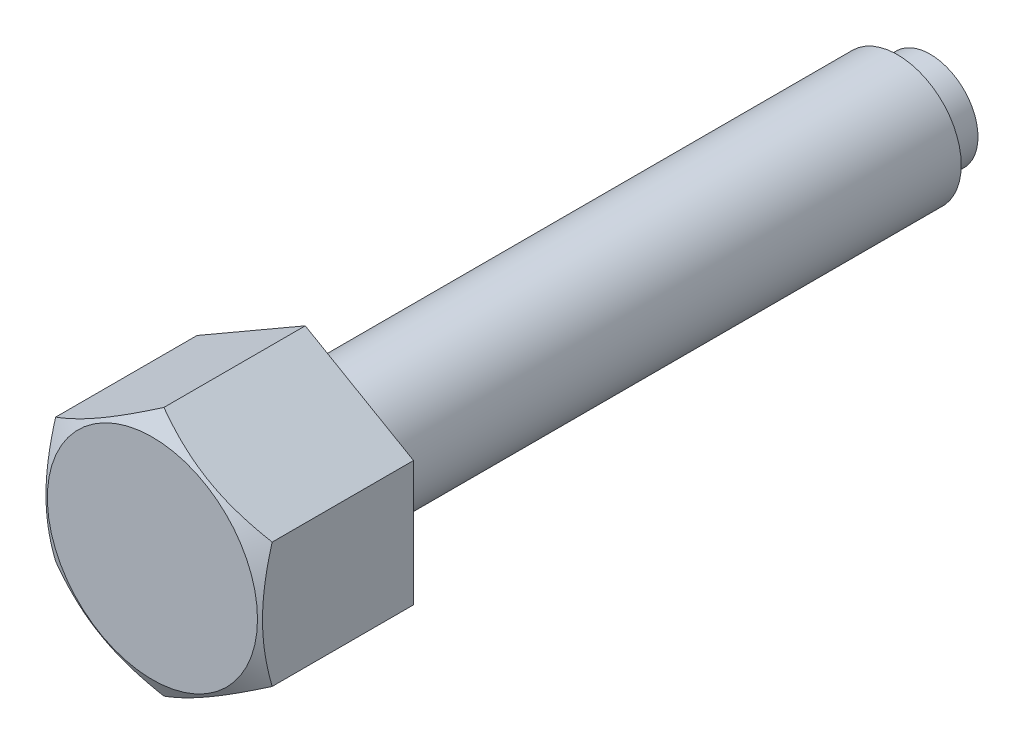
ISO-10303-21;
HEADER;
FILE_DESCRIPTION(('STEP AP214'),'2;1');
FILE_NAME('part.step','',(''),(''),'','','');
FILE_SCHEMA(('AUTOMOTIVE_DESIGN { 1 0 10303 214 1 1 1 1 }'));
ENDSEC;
DATA;
#1=APPLICATION_CONTEXT('core data for automotive mechanical design processes');
#2=APPLICATION_PROTOCOL_DEFINITION('international standard','automotive_design',2000,#1);
#3=PRODUCT_CONTEXT('',#1,'mechanical');
#4=PRODUCT('Part','Part','',(#3));
#5=PRODUCT_RELATED_PRODUCT_CATEGORY('part','',(#4));
#6=PRODUCT_DEFINITION_FORMATION('','',#4);
#7=PRODUCT_DEFINITION_CONTEXT('part definition',#1,'design');
#8=PRODUCT_DEFINITION('design','',#6,#7);
#9=PRODUCT_DEFINITION_SHAPE('','',#8);
#10=(LENGTH_UNIT() NAMED_UNIT(*) SI_UNIT(.MILLI.,.METRE.));
#11=(NAMED_UNIT(*) PLANE_ANGLE_UNIT() SI_UNIT($,.RADIAN.));
#12=(NAMED_UNIT(*) SI_UNIT($,.STERADIAN.) SOLID_ANGLE_UNIT());
#13=UNCERTAINTY_MEASURE_WITH_UNIT(LENGTH_MEASURE(1.E-05),#10,'distance_accuracy_value','');
#14=(GEOMETRIC_REPRESENTATION_CONTEXT(3) GLOBAL_UNCERTAINTY_ASSIGNED_CONTEXT((#13)) GLOBAL_UNIT_ASSIGNED_CONTEXT((#10,
#11,#12)) REPRESENTATION_CONTEXT('',''));
#15=CARTESIAN_POINT('',(0.,0.,0.));
#16=DIRECTION('',(0.,0.,1.));
#17=DIRECTION('',(1.,0.,0.));
#18=AXIS2_PLACEMENT_3D('',#15,#16,#17);
#19=CARTESIAN_POINT('',(0.,9.81495457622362,48.));
#20=DIRECTION('',(-0.5,-0.86602540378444,0.));
#21=DIRECTION('',(0.86602540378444,-0.5,0.));
#22=AXIS2_PLACEMENT_3D('',#19,#20,#21);
#23=PLANE('',#22);
#24=CARTESIAN_POINT('',(8.5002,4.90736181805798,61.0964063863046));
#25=CARTESIAN_POINT('',(8.31336077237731,5.01523349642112,61.1586762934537));
#26=CARTESIAN_POINT('',(8.12582494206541,5.1235073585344,61.2181201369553));
#27=CARTESIAN_POINT('',(7.74923024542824,5.34093440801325,61.3305773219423));
#28=CARTESIAN_POINT('',(7.56017075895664,5.45008795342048,61.3835878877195));
#29=CARTESIAN_POINT('',(6.98996524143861,5.77929626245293,61.5319290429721));
#30=CARTESIAN_POINT('',(6.60656835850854,6.00065055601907,61.6163035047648));
#31=CARTESIAN_POINT('',(6.03282233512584,6.33190297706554,61.7152424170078));
#32=CARTESIAN_POINT('',(5.84418723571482,6.44081150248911,61.7434272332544));
#33=CARTESIAN_POINT('',(5.46606397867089,6.65912106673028,61.7906883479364));
#34=CARTESIAN_POINT('',(5.27657589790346,6.76852206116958,61.8097654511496));
#35=CARTESIAN_POINT('',(4.8972734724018,6.98751241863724,61.8383276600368));
#36=CARTESIAN_POINT('',(4.70745974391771,7.09710142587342,61.8478236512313));
#37=CARTESIAN_POINT('',(4.32765694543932,7.31638067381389,61.8570200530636));
#38=CARTESIAN_POINT('',(4.13766788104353,7.42607091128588,61.8567207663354));
#39=CARTESIAN_POINT('',(3.78247698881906,7.63114046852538,61.8470079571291));
#40=CARTESIAN_POINT('',(3.61725009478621,7.72653426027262,61.838779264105));
#41=CARTESIAN_POINT('',(3.28718328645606,7.91709842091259,61.8150731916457));
#42=CARTESIAN_POINT('',(3.12234339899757,8.01226877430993,61.7995953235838));
#43=CARTESIAN_POINT('',(2.62846189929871,8.29741139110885,61.742653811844));
#44=CARTESIAN_POINT('',(2.30029449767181,8.4868789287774,61.690689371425));
#45=CARTESIAN_POINT('',(1.64047857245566,8.86782383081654,61.5607774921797));
#46=CARTESIAN_POINT('',(1.30891425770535,9.05925257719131,61.4822793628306));
#47=CARTESIAN_POINT('',(0.650730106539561,9.43925537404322,61.30412109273));
#48=CARTESIAN_POINT('',(0.324101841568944,9.62783429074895,61.2045027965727));
#49=CARTESIAN_POINT('',(-0.000199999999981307,9.81507004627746,61.0964063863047));
#50=B_SPLINE_CURVE_WITH_KNOTS('',3,(#24,#25,#26,#27,#28,#29,#30,#31,#32,#33,#34,#35,#36,#37,#38,
#39,#40,#41,#42,#43,#44,#45,#46,#47,#48,#49),.UNSPECIFIED.,.F.,.F.,(4,2,2,2,2,2,2,2,2,2,2,2,4),
(0.,0.673596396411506,1.34748239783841,2.69805431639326,3.356799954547,4.01548737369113,
4.67342558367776,5.33134346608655,5.90409556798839,6.47688628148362,7.62328361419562,
8.79510569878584,9.96462743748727),.UNSPECIFIED.);
#51=CARTESIAN_POINT('',(8.5,4.90747728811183,61.0964730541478));
#52=VERTEX_POINT('',#51);
#53=CARTESIAN_POINT('',(0.,9.81495457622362,61.0964730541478));
#54=VERTEX_POINT('',#53);
#55=EDGE_CURVE('E29',#52,#54,#50,.T.);
#56=ORIENTED_EDGE('',*,*,#55,.F.);
#57=DIRECTION('',(0.,0.,1.));
#58=VECTOR('',#57,1.);
#59=CARTESIAN_POINT('',(8.5,4.90747728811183,48.));
#60=LINE('',#59,#58);
#61=CARTESIAN_POINT('',(8.5,4.90747728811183,50.));
#62=VERTEX_POINT('',#61);
#63=EDGE_CURVE('E96',#62,#52,#60,.T.);
#64=ORIENTED_EDGE('',*,*,#63,.F.);
#65=DIRECTION('',(0.86602540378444,-0.5,0.));
#66=VECTOR('',#65,1.);
#67=CARTESIAN_POINT('',(8.,5.19615242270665,50.));
#68=LINE('',#67,#66);
#69=CARTESIAN_POINT('',(0.,9.81495457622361,50.));
#70=VERTEX_POINT('',#69);
#71=EDGE_CURVE('E110',#70,#62,#68,.T.);
#72=ORIENTED_EDGE('',*,*,#71,.F.);
#73=DIRECTION('',(0.,0.,1.));
#74=VECTOR('',#73,1.);
#75=CARTESIAN_POINT('',(0.,9.81495457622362,48.));
#76=LINE('',#75,#74);
#77=EDGE_CURVE('E36',#70,#54,#76,.T.);
#78=ORIENTED_EDGE('',*,*,#77,.T.);
#79=EDGE_LOOP('',(#56,#64,#72,#78));
#80=FACE_BOUND('',#79,.T.);
#81=ADVANCED_FACE('F14',(#80),#23,.F.);
#82=CARTESIAN_POINT('',(8.5,4.90747728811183,48.));
#83=DIRECTION('',(-1.,0.,0.));
#84=DIRECTION('',(0.,0.,1.));
#85=AXIS2_PLACEMENT_3D('',#82,#83,#84);
#86=PLANE('',#85);
#87=CARTESIAN_POINT('',(8.5,-13.199954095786,57.6987627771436));
#88=CARTESIAN_POINT('',(8.5,-12.8285538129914,57.8789969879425));
#89=CARTESIAN_POINT('',(8.5,-12.4563028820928,58.0575082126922));
#90=CARTESIAN_POINT('',(8.5,-11.7096474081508,58.410116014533));
#91=CARTESIAN_POINT('',(8.5,-11.3352425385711,58.5842118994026));
#92=CARTESIAN_POINT('',(8.5,-10.5819064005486,58.927892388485));
#93=CARTESIAN_POINT('',(8.5,-10.2029615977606,59.0974474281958));
#94=CARTESIAN_POINT('',(8.5,-9.44206432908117,59.4296426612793));
#95=CARTESIAN_POINT('',(8.5,-9.06011200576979,59.5922831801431));
#96=CARTESIAN_POINT('',(8.5,-8.2801924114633,59.9139382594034));
#97=CARTESIAN_POINT('',(8.5,-7.88210625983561,60.0726661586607));
#98=CARTESIAN_POINT('',(8.5,-7.08128418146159,60.3781521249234));
#99=CARTESIAN_POINT('',(8.5,-6.67854773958,60.524908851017));
#100=CARTESIAN_POINT('',(8.5,-5.86852751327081,60.8026124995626));
#101=CARTESIAN_POINT('',(8.5,-5.46125476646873,60.9335912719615));
#102=CARTESIAN_POINT('',(8.5,-4.64088165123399,61.1755495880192));
#103=CARTESIAN_POINT('',(8.5,-4.22778315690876,61.2865354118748));
#104=CARTESIAN_POINT('',(8.5,-3.39775322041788,61.4825945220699));
#105=CARTESIAN_POINT('',(8.5,-2.98085606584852,61.5678090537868));
#106=CARTESIAN_POINT('',(8.5,-2.35169960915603,61.6726226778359));
#107=CARTESIAN_POINT('',(8.5,-2.14133035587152,61.7037272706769));
#108=CARTESIAN_POINT('',(8.5,-1.71954012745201,61.7576573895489));
#109=CARTESIAN_POINT('',(8.5,-1.50811925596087,61.7804837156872));
#110=CARTESIAN_POINT('',(8.5,-1.08727895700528,61.8171153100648));
#111=CARTESIAN_POINT('',(8.5,-0.877869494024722,61.8310346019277));
#112=CARTESIAN_POINT('',(8.5,-0.458649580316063,61.850004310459));
#113=CARTESIAN_POINT('',(8.5,-0.248839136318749,61.8550548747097));
#114=CARTESIAN_POINT('',(8.5,0.17080753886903,61.8561665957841));
#115=CARTESIAN_POINT('',(8.5,0.380643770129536,61.8522277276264));
#116=CARTESIAN_POINT('',(8.5,0.799963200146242,61.8354570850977));
#117=CARTESIAN_POINT('',(8.5,1.00944638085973,61.8226248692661));
#118=CARTESIAN_POINT('',(8.5,1.51235445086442,61.7814150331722));
#119=CARTESIAN_POINT('',(8.5,1.80544333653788,61.7488480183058));
#120=CARTESIAN_POINT('',(8.5,2.38944378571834,61.6680780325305));
#121=CARTESIAN_POINT('',(8.5,2.68035504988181,61.6198729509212));
#122=CARTESIAN_POINT('',(8.5,3.5494909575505,61.4543568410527));
#123=CARTESIAN_POINT('',(8.5,4.12379349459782,61.316175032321));
#124=CARTESIAN_POINT('',(8.5,4.9825522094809,61.0765739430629));
#125=CARTESIAN_POINT('',(8.5,5.27146309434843,60.9902027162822));
#126=CARTESIAN_POINT('',(8.5,5.84647878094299,60.8084934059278));
#127=CARTESIAN_POINT('',(8.5,6.13258356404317,60.7131552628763));
#128=CARTESIAN_POINT('',(8.5,6.70207709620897,60.5150414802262));
#129=CARTESIAN_POINT('',(8.5,6.98546670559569,60.4122682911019));
#130=CARTESIAN_POINT('',(8.5,7.54989820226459,60.2004932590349));
#131=CARTESIAN_POINT('',(8.5,7.8309401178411,60.0914914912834));
#132=CARTESIAN_POINT('',(8.5,8.49732843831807,59.8258893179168));
#133=CARTESIAN_POINT('',(8.5,8.88173638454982,59.6669386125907));
#134=CARTESIAN_POINT('',(8.5,9.64725587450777,59.3412652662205));
#135=CARTESIAN_POINT('',(8.5,10.0283672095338,59.1745421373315));
#136=CARTESIAN_POINT('',(8.5,10.7879128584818,58.8348914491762));
#137=CARTESIAN_POINT('',(8.5,11.1663465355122,58.6619624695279));
#138=CARTESIAN_POINT('',(8.5,11.9208996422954,58.3111608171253));
#139=CARTESIAN_POINT('',(8.5,12.2970191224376,58.1332882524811));
#140=CARTESIAN_POINT('',(8.5,13.0477502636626,57.7733304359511));
#141=CARTESIAN_POINT('',(8.5,13.4223597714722,57.5912407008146));
#142=CARTESIAN_POINT('',(8.5,14.1699554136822,57.2237599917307));
#143=CARTESIAN_POINT('',(8.5,14.5429415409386,57.0383690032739));
#144=CARTESIAN_POINT('',(8.5,15.6597570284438,56.4781764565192));
#145=CARTESIAN_POINT('',(8.5,16.4015452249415,56.0993061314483));
#146=CARTESIAN_POINT('',(8.5,17.8184701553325,55.3663857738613));
#147=CARTESIAN_POINT('',(8.5,18.4939278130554,55.0129533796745));
#148=CARTESIAN_POINT('',(8.5,19.8423362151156,54.3012826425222));
#149=CARTESIAN_POINT('',(8.5,20.5152868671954,53.9430441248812));
#150=CARTESIAN_POINT('',(8.5,21.8575279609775,53.2238256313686));
#151=CARTESIAN_POINT('',(8.5,22.5268233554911,52.862854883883));
#152=CARTESIAN_POINT('',(8.5,23.8638133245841,52.1380488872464));
#153=CARTESIAN_POINT('',(8.5,24.5315079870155,51.7742138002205));
#154=CARTESIAN_POINT('',(8.5,25.1986146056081,51.4093109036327));
#155=B_SPLINE_CURVE_WITH_KNOTS('',3,(#87,#88,#89,#90,#91,#92,#93,#94,#95,#96,#97,#98,#99,#100,
#101,#102,#103,#104,#105,#106,#107,#108,#109,#110,#111,#112,#113,#114,#115,#116,#117,#118,#119,
#120,#121,#122,#123,#124,#125,#126,#127,#128,#129,#130,#131,#132,#133,#134,#135,#136,#137,#138,
#139,#140,#141,#142,#143,#144,#145,#146,#147,#148,#149,#150,#151,#152,#153,#154),.UNSPECIFIED.,
.F.,.F.,(4,2,2,2,2,2,2,2,2,2,2,2,2,2,2,2,2,2,2,2,2,2,2,2,2,2,2,2,2,2,2,2,2,4),(0.,
1.23848298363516,2.47715894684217,3.72254834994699,4.96787906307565,6.25342174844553,
7.53910823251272,8.82215427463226,10.1047965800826,11.3802760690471,12.0181078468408,
12.6558779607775,13.2853110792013,13.9147337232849,14.5441581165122,15.1736137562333,
16.0577925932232,16.9420908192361,18.7116597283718,19.6162196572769,20.5207855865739,
21.4250547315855,22.329312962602,23.5771207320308,24.8250069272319,26.0731805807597,
27.3213269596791,28.5708673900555,29.8204133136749,32.3191662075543,34.6061562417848,
36.8932296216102,39.174516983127,41.4556761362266),.UNSPECIFIED.);
#156=CARTESIAN_POINT('',(8.5,-4.90747728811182,61.0964730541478));
#157=VERTEX_POINT('',#156);
#158=EDGE_CURVE('E156',#157,#52,#155,.T.);
#159=ORIENTED_EDGE('',*,*,#158,.F.);
#160=DIRECTION('',(0.,0.,1.));
#161=VECTOR('',#160,1.);
#162=CARTESIAN_POINT('',(8.5,-4.90747728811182,48.));
#163=LINE('',#162,#161);
#164=CARTESIAN_POINT('',(8.5,-4.90747728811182,50.));
#165=VERTEX_POINT('',#164);
#166=EDGE_CURVE('E93',#165,#157,#163,.T.);
#167=ORIENTED_EDGE('',*,*,#166,.F.);
#168=DIRECTION('',(0.,-1.,0.));
#169=VECTOR('',#168,1.);
#170=CARTESIAN_POINT('',(8.5,0.,50.));
#171=LINE('',#170,#169);
#172=EDGE_CURVE('E107',#62,#165,#171,.T.);
#173=ORIENTED_EDGE('',*,*,#172,.F.);
#174=ORIENTED_EDGE('',*,*,#63,.T.);
#175=EDGE_LOOP('',(#159,#167,#173,#174));
#176=FACE_BOUND('',#175,.T.);
#177=ADVANCED_FACE('F136',(#176),#86,.F.);
#178=CARTESIAN_POINT('',(0.,-9.81495457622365,48.));
#179=DIRECTION('',(0.5,-0.866025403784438,0.));
#180=DIRECTION('',(0.866025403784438,0.5,0.));
#181=AXIS2_PLACEMENT_3D('',#178,#179,#180);
#182=PLANE('',#181);
#183=ORIENTED_EDGE('',*,*,#166,.T.);
#184=CARTESIAN_POINT('',(8.5002,-4.90736181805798,61.0964063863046));
#185=CARTESIAN_POINT('',(8.31336077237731,-5.01523349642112,61.1586762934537));
#186=CARTESIAN_POINT('',(8.12582494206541,-5.1235073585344,61.2181201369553));
#187=CARTESIAN_POINT('',(7.74923024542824,-5.34093440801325,61.3305773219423));
#188=CARTESIAN_POINT('',(7.56017075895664,-5.45008795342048,61.3835878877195));
#189=CARTESIAN_POINT('',(6.9899652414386,-5.77929626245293,61.5319290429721));
#190=CARTESIAN_POINT('',(6.60656835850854,-6.00065055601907,61.6163035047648));
#191=CARTESIAN_POINT('',(6.03282233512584,-6.33190297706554,61.7152424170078));
#192=CARTESIAN_POINT('',(5.84418723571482,-6.44081150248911,61.7434272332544));
#193=CARTESIAN_POINT('',(5.46606397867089,-6.65912106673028,61.7906883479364));
#194=CARTESIAN_POINT('',(5.27657589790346,-6.76852206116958,61.8097654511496));
#195=CARTESIAN_POINT('',(4.8972734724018,-6.98751241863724,61.8383276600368));
#196=CARTESIAN_POINT('',(4.70745974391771,-7.09710142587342,61.8478236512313));
#197=CARTESIAN_POINT('',(4.32765694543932,-7.31638067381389,61.8570200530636));
#198=CARTESIAN_POINT('',(4.13766788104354,-7.42607091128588,61.8567207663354));
#199=CARTESIAN_POINT('',(3.78247698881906,-7.63114046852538,61.8470079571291));
#200=CARTESIAN_POINT('',(3.61725009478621,-7.72653426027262,61.838779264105));
#201=CARTESIAN_POINT('',(3.28718328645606,-7.91709842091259,61.8150731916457));
#202=CARTESIAN_POINT('',(3.12234339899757,-8.01226877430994,61.7995953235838));
#203=CARTESIAN_POINT('',(2.62846189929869,-8.29741139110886,61.742653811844));
#204=CARTESIAN_POINT('',(2.30029449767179,-8.48687892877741,61.690689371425));
#205=CARTESIAN_POINT('',(1.64047857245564,-8.86782383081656,61.5607774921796));
#206=CARTESIAN_POINT('',(1.30891425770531,-9.05925257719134,61.4822793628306));
#207=CARTESIAN_POINT('',(0.65073010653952,-9.43925537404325,61.30412109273));
#208=CARTESIAN_POINT('',(0.324101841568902,-9.62783429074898,61.2045027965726));
#209=CARTESIAN_POINT('',(-0.000200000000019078,-9.81507004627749,61.0964063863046));
#210=B_SPLINE_CURVE_WITH_KNOTS('',3,(#184,#185,#186,#187,#188,#189,#190,#191,#192,#193,#194,
#195,#196,#197,#198,#199,#200,#201,#202,#203,#204,#205,#206,#207,#208,#209),.UNSPECIFIED.,.F.,
.F.,(4,2,2,2,2,2,2,2,2,2,2,2,4),(0.,0.673596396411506,1.34748239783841,2.69805431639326,
3.356799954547,4.01548737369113,4.67342558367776,5.33134346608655,5.90409556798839,
6.47688628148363,7.62328361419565,8.79510569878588,9.96462743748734),.UNSPECIFIED.);
#211=CARTESIAN_POINT('',(0.,-9.81495457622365,61.0964730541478));
#212=VERTEX_POINT('',#211);
#213=EDGE_CURVE('E162',#157,#212,#210,.T.);
#214=ORIENTED_EDGE('',*,*,#213,.T.);
#215=DIRECTION('',(0.,0.,1.));
#216=VECTOR('',#215,1.);
#217=CARTESIAN_POINT('',(0.,-9.81495457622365,48.));
#218=LINE('',#217,#216);
#219=CARTESIAN_POINT('',(0.,-9.81495457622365,50.));
#220=VERTEX_POINT('',#219);
#221=EDGE_CURVE('E86',#220,#212,#218,.T.);
#222=ORIENTED_EDGE('',*,*,#221,.F.);
#223=DIRECTION('',(0.866025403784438,0.5,0.));
#224=VECTOR('',#223,1.);
#225=CARTESIAN_POINT('',(8.,-5.19615242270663,50.));
#226=LINE('',#225,#224);
#227=EDGE_CURVE('E105',#220,#165,#226,.T.);
#228=ORIENTED_EDGE('',*,*,#227,.T.);
#229=EDGE_LOOP('',(#183,#214,#222,#228));
#230=FACE_BOUND('',#229,.T.);
#231=ADVANCED_FACE('F142',(#230),#182,.T.);
#232=CARTESIAN_POINT('',(0.,-9.81495457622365,48.));
#233=DIRECTION('',(0.5,0.866025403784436,0.));
#234=DIRECTION('',(-0.866025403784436,0.5,0.));
#235=AXIS2_PLACEMENT_3D('',#232,#233,#234);
#236=PLANE('',#235);
#237=CARTESIAN_POINT('',(-8.5002,-4.90736181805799,61.0964063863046));
#238=CARTESIAN_POINT('',(-8.31336077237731,-5.01523349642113,61.1586762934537));
#239=CARTESIAN_POINT('',(-8.1258249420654,-5.12350735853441,61.2181201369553));
#240=CARTESIAN_POINT('',(-7.74923024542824,-5.34093440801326,61.3305773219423));
#241=CARTESIAN_POINT('',(-7.56017075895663,-5.4500879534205,61.3835878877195));
#242=CARTESIAN_POINT('',(-6.98996524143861,-5.77929626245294,61.5319290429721));
#243=CARTESIAN_POINT('',(-6.60656835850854,-6.00065055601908,61.6163035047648));
#244=CARTESIAN_POINT('',(-6.03282233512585,-6.33190297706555,61.7152424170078));
#245=CARTESIAN_POINT('',(-5.84418723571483,-6.44081150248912,61.7434272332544));
#246=CARTESIAN_POINT('',(-5.4660639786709,-6.65912106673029,61.7906883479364));
#247=CARTESIAN_POINT('',(-5.27657589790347,-6.76852206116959,61.8097654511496));
#248=CARTESIAN_POINT('',(-4.89727347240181,-6.98751241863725,61.8383276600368));
#249=CARTESIAN_POINT('',(-4.70745974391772,-7.09710142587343,61.8478236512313));
#250=CARTESIAN_POINT('',(-4.32765694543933,-7.3163806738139,61.8570200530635));
#251=CARTESIAN_POINT('',(-4.13766788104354,-7.4260709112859,61.8567207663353));
#252=CARTESIAN_POINT('',(-3.78247698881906,-7.6311404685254,61.847007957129));
#253=CARTESIAN_POINT('',(-3.61725009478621,-7.72653426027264,61.838779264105));
#254=CARTESIAN_POINT('',(-3.28718328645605,-7.91709842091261,61.8150731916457));
#255=CARTESIAN_POINT('',(-3.12234339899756,-8.01226877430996,61.7995953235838));
#256=CARTESIAN_POINT('',(-2.6284618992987,-8.29741139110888,61.7426538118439));
#257=CARTESIAN_POINT('',(-2.3002944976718,-8.48687892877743,61.690689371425));
#258=CARTESIAN_POINT('',(-1.64047857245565,-8.86782383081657,61.5607774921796));
#259=CARTESIAN_POINT('',(-1.30891425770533,-9.05925257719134,61.4822793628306));
#260=CARTESIAN_POINT('',(-0.650730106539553,-9.43925537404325,61.30412109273));
#261=CARTESIAN_POINT('',(-0.324101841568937,-9.62783429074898,61.2045027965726));
#262=CARTESIAN_POINT('',(0.000199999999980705,-9.81507004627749,61.0964063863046));
#263=B_SPLINE_CURVE_WITH_KNOTS('',3,(#237,#238,#239,#240,#241,#242,#243,#244,#245,#246,#247,
#248,#249,#250,#251,#252,#253,#254,#255,#256,#257,#258,#259,#260,#261,#262),.UNSPECIFIED.,.F.,
.F.,(4,2,2,2,2,2,2,2,2,2,2,2,4),(0.,0.673596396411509,1.34748239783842,2.69805431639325,
3.35679995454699,4.01548737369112,4.67342558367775,5.33134346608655,5.90409556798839,
6.47688628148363,7.62328361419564,8.79510569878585,9.96462743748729),.UNSPECIFIED.);
#264=CARTESIAN_POINT('',(-8.5,-4.90747728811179,61.0964730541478));
#265=VERTEX_POINT('',#264);
#266=EDGE_CURVE('E80',#265,#212,#263,.T.);
#267=ORIENTED_EDGE('',*,*,#266,.F.);
#268=DIRECTION('',(0.,0.,1.));
#269=VECTOR('',#268,1.);
#270=CARTESIAN_POINT('',(-8.5,-4.90747728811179,48.));
#271=LINE('',#270,#269);
#272=CARTESIAN_POINT('',(-8.5,-4.90747728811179,50.));
#273=VERTEX_POINT('',#272);
#274=EDGE_CURVE('E79',#273,#265,#271,.T.);
#275=ORIENTED_EDGE('',*,*,#274,.F.);
#276=DIRECTION('',(-0.866025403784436,0.5,0.));
#277=VECTOR('',#276,1.);
#278=CARTESIAN_POINT('',(-0.500000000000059,-9.52627944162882,50.));
#279=LINE('',#278,#277);
#280=EDGE_CURVE('E102',#220,#273,#279,.T.);
#281=ORIENTED_EDGE('',*,*,#280,.F.);
#282=ORIENTED_EDGE('',*,*,#221,.T.);
#283=EDGE_LOOP('',(#267,#275,#281,#282));
#284=FACE_BOUND('',#283,.T.);
#285=ADVANCED_FACE('F238',(#284),#236,.F.);
#286=CARTESIAN_POINT('',(-8.5,4.90747728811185,48.));
#287=DIRECTION('',(-1.,0.,0.));
#288=DIRECTION('',(0.,-1.,0.));
#289=AXIS2_PLACEMENT_3D('',#286,#287,#288);
#290=PLANE('',#289);
#291=ORIENTED_EDGE('',*,*,#274,.T.);
#292=CARTESIAN_POINT('',(-8.5,-13.1999540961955,57.6987627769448));
#293=CARTESIAN_POINT('',(-8.5,-12.8285538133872,57.8789969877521));
#294=CARTESIAN_POINT('',(-8.5,-12.4563028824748,58.05750821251));
#295=CARTESIAN_POINT('',(-8.5,-11.7096474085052,58.4101160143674));
#296=CARTESIAN_POINT('',(-8.5,-11.3352425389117,58.5842118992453));
#297=CARTESIAN_POINT('',(-8.5,-10.5819064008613,58.9278923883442));
#298=CARTESIAN_POINT('',(-8.5,-10.2029615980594,59.0974474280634));
#299=CARTESIAN_POINT('',(-8.5,-9.44206432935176,59.4296426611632));
#300=CARTESIAN_POINT('',(-8.5,-9.06011200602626,59.5922831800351));
#301=CARTESIAN_POINT('',(-8.5,-8.28019241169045,59.9139382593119));
#302=CARTESIAN_POINT('',(-8.5,-7.88210626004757,60.0726661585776));
#303=CARTESIAN_POINT('',(-8.5,-7.08128418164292,60.3781521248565));
#304=CARTESIAN_POINT('',(-8.5,-6.67854773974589,60.5249088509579));
#305=CARTESIAN_POINT('',(-8.5,-5.86852751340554,60.8026124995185));
#306=CARTESIAN_POINT('',(-8.5,-5.46125476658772,60.9335912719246));
#307=CARTESIAN_POINT('',(-8.5,-4.6408816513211,61.1755495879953));
#308=CARTESIAN_POINT('',(-8.5,-4.22778315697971,61.2865354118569));
#309=CARTESIAN_POINT('',(-8.5,-3.3977532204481,61.4825945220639));
#310=CARTESIAN_POINT('',(-8.5,-2.98085606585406,61.5678090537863));
#311=CARTESIAN_POINT('',(-8.5,-2.35169960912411,61.672622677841));
#312=CARTESIAN_POINT('',(-8.5,-2.14133035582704,61.7037272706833));
#313=CARTESIAN_POINT('',(-8.5,-1.71954012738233,61.7576573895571));
#314=CARTESIAN_POINT('',(-8.5,-1.50811925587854,61.7804837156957));
#315=CARTESIAN_POINT('',(-8.5,-1.0872789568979,61.8171153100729));
#316=CARTESIAN_POINT('',(-8.5,-0.877869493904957,61.831034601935));
#317=CARTESIAN_POINT('',(-8.5,-0.458649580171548,61.8500043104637));
#318=CARTESIAN_POINT('',(-8.5,-0.248839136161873,61.8550548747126));
#319=CARTESIAN_POINT('',(-8.5,0.17080753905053,61.8561665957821));
#320=CARTESIAN_POINT('',(-8.5,0.380643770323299,61.8522277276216));
#321=CARTESIAN_POINT('',(-8.5,0.799963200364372,61.8354570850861));
#322=CARTESIAN_POINT('',(-8.5,1.00944638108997,61.8226248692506));
#323=CARTESIAN_POINT('',(-8.5,1.51235445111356,61.7814150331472));
#324=CARTESIAN_POINT('',(-8.5,1.80544333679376,61.7488480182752));
#325=CARTESIAN_POINT('',(-8.5,2.3894437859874,61.6680780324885));
#326=CARTESIAN_POINT('',(-8.5,2.68035505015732,61.6198729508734));
#327=CARTESIAN_POINT('',(-8.5,3.54949095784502,61.4543568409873));
#328=CARTESIAN_POINT('',(-8.5,4.12379349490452,61.3161750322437));
#329=CARTESIAN_POINT('',(-8.5,4.98255220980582,61.076573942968));
#330=CARTESIAN_POINT('',(-8.5,5.27146309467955,60.9902027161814));
#331=CARTESIAN_POINT('',(-8.5,5.84647878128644,60.8084934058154));
#332=CARTESIAN_POINT('',(-8.5,6.13258356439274,60.7131552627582));
#333=CARTESIAN_POINT('',(-8.5,6.70207709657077,60.5150414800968));
#334=CARTESIAN_POINT('',(-8.5,6.98546670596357,60.412268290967));
#335=CARTESIAN_POINT('',(-8.5,7.54989820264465,60.2004932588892));
#336=CARTESIAN_POINT('',(-8.5,7.83094011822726,60.0914914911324));
#337=CARTESIAN_POINT('',(-8.5,8.49732843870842,59.8258893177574));
#338=CARTESIAN_POINT('',(-8.5,8.88173638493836,59.6669386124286));
#339=CARTESIAN_POINT('',(-8.5,9.6472558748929,59.3412652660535));
#340=CARTESIAN_POINT('',(-8.5,10.0283672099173,59.1745421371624));
#341=CARTESIAN_POINT('',(-8.5,10.7879128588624,58.8348914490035));
#342=CARTESIAN_POINT('',(-8.5,11.1663465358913,58.6619624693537));
#343=CARTESIAN_POINT('',(-8.5,11.9208996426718,58.3111608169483));
#344=CARTESIAN_POINT('',(-8.5,12.2970191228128,58.1332882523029));
#345=CARTESIAN_POINT('',(-8.5,13.0477502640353,57.7733304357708));
#346=CARTESIAN_POINT('',(-8.5,13.4223597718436,57.5912407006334));
#347=CARTESIAN_POINT('',(-8.5,14.1699554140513,57.2237599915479));
#348=CARTESIAN_POINT('',(-8.5,14.5429415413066,57.0383690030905));
#349=CARTESIAN_POINT('',(-8.5,15.6597570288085,56.478176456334));
#350=CARTESIAN_POINT('',(-8.5,16.4015452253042,56.0993061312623));
#351=CARTESIAN_POINT('',(-8.5,17.8184701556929,55.3663857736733));
#352=CARTESIAN_POINT('',(-8.5,18.4939278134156,55.0129533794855));
#353=CARTESIAN_POINT('',(-8.5,19.8423362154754,54.3012826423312));
#354=CARTESIAN_POINT('',(-8.5,20.5152868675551,53.9430441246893));
#355=CARTESIAN_POINT('',(-8.5,21.857527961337,53.2238256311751));
#356=CARTESIAN_POINT('',(-8.5,22.5268233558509,52.8628548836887));
#357=CARTESIAN_POINT('',(-8.5,23.8638133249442,52.1380488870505));
#358=CARTESIAN_POINT('',(-8.5,24.5315079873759,51.7742138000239));
#359=CARTESIAN_POINT('',(-8.5,25.1986146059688,51.4093109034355));
#360=B_SPLINE_CURVE_WITH_KNOTS('',3,(#292,#293,#294,#295,#296,#297,#298,#299,#300,#301,#302,
#303,#304,#305,#306,#307,#308,#309,#310,#311,#312,#313,#314,#315,#316,#317,#318,#319,#320,#321,
#322,#323,#324,#325,#326,#327,#328,#329,#330,#331,#332,#333,#334,#335,#336,#337,#338,#339,#340,
#341,#342,#343,#344,#345,#346,#347,#348,#349,#350,#351,#352,#353,#354,#355,#356,#357,#358,#359),
.UNSPECIFIED.,.F.,.F.,(4,2,2,2,2,2,2,2,2,2,2,2,2,2,2,2,2,2,2,2,2,2,2,2,2,2,2,2,2,2,2,2,2,4),(0.,
1.23848298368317,2.47715894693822,3.72254835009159,4.96787906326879,6.25342174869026,
7.53910823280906,8.82215427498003,10.1047965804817,11.3802760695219,12.0181078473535,
12.655877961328,13.2853110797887,13.9147337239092,14.5441581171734,15.1736137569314,
16.0577925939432,16.9420908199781,18.7116597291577,19.6162196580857,20.5207855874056,
21.42505473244,22.3293129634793,23.5771207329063,24.8250069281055,26.0731805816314,
27.3213269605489,28.5708673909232,29.8204133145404,32.3191662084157,34.606156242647,
36.8932296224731,39.1745169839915,41.4556761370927),.UNSPECIFIED.);
#361=CARTESIAN_POINT('',(-8.5,4.90747728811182,61.0964730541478));
#362=VERTEX_POINT('',#361);
#363=EDGE_CURVE('E67',#265,#362,#360,.T.);
#364=ORIENTED_EDGE('',*,*,#363,.T.);
#365=DIRECTION('',(0.,0.,1.));
#366=VECTOR('',#365,1.);
#367=CARTESIAN_POINT('',(-8.5,4.90747728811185,48.));
#368=LINE('',#367,#366);
#369=CARTESIAN_POINT('',(-8.5,4.90747728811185,50.));
#370=VERTEX_POINT('',#369);
#371=EDGE_CURVE('E76',#370,#362,#368,.T.);
#372=ORIENTED_EDGE('',*,*,#371,.F.);
#373=DIRECTION('',(0.,-1.,0.));
#374=VECTOR('',#373,1.);
#375=CARTESIAN_POINT('',(-8.5,0.,50.));
#376=LINE('',#375,#374);
#377=EDGE_CURVE('E100',#370,#273,#376,.T.);
#378=ORIENTED_EDGE('',*,*,#377,.T.);
#379=EDGE_LOOP('',(#291,#364,#372,#378));
#380=FACE_BOUND('',#379,.T.);
#381=ADVANCED_FACE('F75',(#380),#290,.T.);
#382=CARTESIAN_POINT('',(0.,9.81495457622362,48.));
#383=DIRECTION('',(-0.5,0.866025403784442,0.));
#384=DIRECTION('',(-0.866025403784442,-0.5,0.));
#385=AXIS2_PLACEMENT_3D('',#382,#383,#384);
#386=PLANE('',#385);
#387=ORIENTED_EDGE('',*,*,#371,.T.);
#388=CARTESIAN_POINT('',(-8.5002,4.90736181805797,61.0964063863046));
#389=CARTESIAN_POINT('',(-8.31336077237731,5.01523349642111,61.1586762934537));
#390=CARTESIAN_POINT('',(-8.12582494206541,5.12350735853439,61.2181201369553));
#391=CARTESIAN_POINT('',(-7.74923024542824,5.34093440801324,61.3305773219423));
#392=CARTESIAN_POINT('',(-7.56017075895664,5.45008795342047,61.3835878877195));
#393=CARTESIAN_POINT('',(-6.98996524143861,5.77929626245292,61.5319290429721));
#394=CARTESIAN_POINT('',(-6.60656835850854,6.00065055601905,61.6163035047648));
#395=CARTESIAN_POINT('',(-6.03282233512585,6.33190297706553,61.7152424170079));
#396=CARTESIAN_POINT('',(-5.84418723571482,6.44081150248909,61.7434272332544));
#397=CARTESIAN_POINT('',(-5.4660639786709,6.65912106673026,61.7906883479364));
#398=CARTESIAN_POINT('',(-5.27657589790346,6.76852206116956,61.8097654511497));
#399=CARTESIAN_POINT('',(-4.89727347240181,6.98751241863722,61.8383276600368));
#400=CARTESIAN_POINT('',(-4.70745974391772,7.0971014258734,61.8478236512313));
#401=CARTESIAN_POINT('',(-4.32765694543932,7.31638067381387,61.8570200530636));
#402=CARTESIAN_POINT('',(-4.13766788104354,7.42607091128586,61.8567207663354));
#403=CARTESIAN_POINT('',(-3.78247698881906,7.63114046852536,61.8470079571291));
#404=CARTESIAN_POINT('',(-3.61725009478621,7.7265342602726,61.8387792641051));
#405=CARTESIAN_POINT('',(-3.28718328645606,7.91709842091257,61.8150731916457));
#406=CARTESIAN_POINT('',(-3.12234339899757,8.01226877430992,61.7995953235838));
#407=CARTESIAN_POINT('',(-2.6284618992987,8.29741139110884,61.742653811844));
#408=CARTESIAN_POINT('',(-2.30029449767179,8.48687892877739,61.690689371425));
#409=CARTESIAN_POINT('',(-1.64047857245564,8.86782383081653,61.5607774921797));
#410=CARTESIAN_POINT('',(-1.30891425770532,9.05925257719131,61.4822793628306));
#411=CARTESIAN_POINT('',(-0.65073010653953,9.43925537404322,61.30412109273));
#412=CARTESIAN_POINT('',(-0.32410184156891,9.62783429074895,61.2045027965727));
#413=CARTESIAN_POINT('',(0.000200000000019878,9.81507004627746,61.0964063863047));
#414=B_SPLINE_CURVE_WITH_KNOTS('',3,(#388,#389,#390,#391,#392,#393,#394,#395,#396,#397,#398,
#399,#400,#401,#402,#403,#404,#405,#406,#407,#408,#409,#410,#411,#412,#413),.UNSPECIFIED.,.F.,
.F.,(4,2,2,2,2,2,2,2,2,2,2,2,4),(0.,0.673596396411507,1.34748239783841,2.69805431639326,
3.356799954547,4.01548737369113,4.67342558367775,5.33134346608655,5.90409556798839,
6.47688628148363,7.62328361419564,8.79510569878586,9.96462743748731),.UNSPECIFIED.);
#415=EDGE_CURVE('E64',#362,#54,#414,.T.);
#416=ORIENTED_EDGE('',*,*,#415,.T.);
#417=ORIENTED_EDGE('',*,*,#77,.F.);
#418=DIRECTION('',(-0.866025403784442,-0.5,0.));
#419=VECTOR('',#418,1.);
#420=CARTESIAN_POINT('',(-0.499999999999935,9.52627944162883,50.));
#421=LINE('',#420,#419);
#422=EDGE_CURVE('E84',#70,#370,#421,.T.);
#423=ORIENTED_EDGE('',*,*,#422,.T.);
#424=EDGE_LOOP('',(#387,#416,#417,#423));
#425=FACE_BOUND('',#424,.T.);
#426=ADVANCED_FACE('F82',(#425),#386,.T.);
#427=CARTESIAN_POINT('',(0.,0.,8.));
#428=DIRECTION('',(0.,0.,1.));
#429=DIRECTION('',(1.,0.,0.));
#430=AXIS2_PLACEMENT_3D('',#427,#428,#429);
#431=SPHERICAL_SURFACE('',#430,8.);
#432=CARTESIAN_POINT('',(0.,0.,0.933352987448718));
#433=DIRECTION('',(0.,0.,1.));
#434=DIRECTION('',(1.,0.,0.));
#435=AXIS2_PLACEMENT_3D('',#432,#433,#434);
#436=CIRCLE('',#435,3.75);
#437=CARTESIAN_POINT('',(3.75,0.,0.933352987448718));
#438=VERTEX_POINT('',#437);
#439=EDGE_CURVE('E9',#438,#438,#436,.T.);
#440=ORIENTED_EDGE('',*,*,#439,.F.);
#441=EDGE_LOOP('',(#440));
#442=FACE_BOUND('',#441,.T.);
#443=ADVANCED_FACE('F16',(#442),#431,.T.);
#444=CARTESIAN_POINT('',(0.,0.,110.));
#445=DIRECTION('',(0.,0.,1.));
#446=DIRECTION('',(1.,0.,0.));
#447=AXIS2_PLACEMENT_3D('',#444,#445,#446);
#448=CYLINDRICAL_SURFACE('',#447,3.75);
#449=ORIENTED_EDGE('',*,*,#439,.T.);
#450=EDGE_LOOP('',(#449));
#451=FACE_BOUND('',#450,.T.);
#452=CARTESIAN_POINT('',(0.,0.,3.5));
#453=DIRECTION('',(0.,0.,1.));
#454=DIRECTION('',(1.,0.,0.));
#455=AXIS2_PLACEMENT_3D('',#452,#453,#454);
#456=CIRCLE('',#455,3.75);
#457=CARTESIAN_POINT('',(3.75,0.,3.5));
#458=VERTEX_POINT('',#457);
#459=EDGE_CURVE('E22',#458,#458,#456,.T.);
#460=ORIENTED_EDGE('',*,*,#459,.F.);
#461=EDGE_LOOP('',(#460));
#462=FACE_BOUND('',#461,.T.);
#463=ADVANCED_FACE('F123',(#451,#462),#448,.T.);
#464=CARTESIAN_POINT('',(3.75,0.,3.5));
#465=DIRECTION('',(0.,0.,1.));
#466=DIRECTION('',(1.,0.,0.));
#467=AXIS2_PLACEMENT_3D('',#464,#465,#466);
#468=PLANE('',#467);
#469=CARTESIAN_POINT('',(0.,0.,3.5));
#470=DIRECTION('',(0.,0.,1.));
#471=DIRECTION('',(1.,0.,0.));
#472=AXIS2_PLACEMENT_3D('',#469,#470,#471);
#473=CIRCLE('',#472,5.);
#474=CARTESIAN_POINT('',(5.,0.,3.5));
#475=VERTEX_POINT('',#474);
#476=EDGE_CURVE('E116',#475,#475,#473,.T.);
#477=ORIENTED_EDGE('',*,*,#476,.F.);
#478=EDGE_LOOP('',(#477));
#479=FACE_BOUND('',#478,.T.);
#480=ORIENTED_EDGE('',*,*,#459,.T.);
#481=EDGE_LOOP('',(#480));
#482=FACE_BOUND('',#481,.T.);
#483=ADVANCED_FACE('F121',(#479,#482),#468,.F.);
#484=CARTESIAN_POINT('',(0.,0.,110.));
#485=DIRECTION('',(0.,0.,1.));
#486=DIRECTION('',(1.,0.,0.));
#487=AXIS2_PLACEMENT_3D('',#484,#485,#486);
#488=CYLINDRICAL_SURFACE('',#487,5.);
#489=CARTESIAN_POINT('',(0.,0.,50.));
#490=DIRECTION('',(0.,0.,1.));
#491=DIRECTION('',(1.,0.,0.));
#492=AXIS2_PLACEMENT_3D('',#489,#490,#491);
#493=CIRCLE('',#492,5.);
#494=CARTESIAN_POINT('',(5.,0.,50.));
#495=VERTEX_POINT('',#494);
#496=EDGE_CURVE('E113',#495,#495,#493,.T.);
#497=ORIENTED_EDGE('',*,*,#496,.F.);
#498=EDGE_LOOP('',(#497));
#499=FACE_BOUND('',#498,.T.);
#500=ORIENTED_EDGE('',*,*,#476,.T.);
#501=EDGE_LOOP('',(#500));
#502=FACE_BOUND('',#501,.T.);
#503=ADVANCED_FACE('F131',(#499,#502),#488,.T.);
#504=CARTESIAN_POINT('',(5.,0.,50.));
#505=DIRECTION('',(0.,0.,1.));
#506=DIRECTION('',(1.,0.,0.));
#507=AXIS2_PLACEMENT_3D('',#504,#505,#506);
#508=PLANE('',#507);
#509=ORIENTED_EDGE('',*,*,#422,.F.);
#510=ORIENTED_EDGE('',*,*,#71,.T.);
#511=ORIENTED_EDGE('',*,*,#172,.T.);
#512=ORIENTED_EDGE('',*,*,#227,.F.);
#513=ORIENTED_EDGE('',*,*,#280,.T.);
#514=ORIENTED_EDGE('',*,*,#377,.F.);
#515=EDGE_LOOP('',(#509,#510,#511,#512,#513,#514));
#516=FACE_BOUND('',#515,.T.);
#517=ORIENTED_EDGE('',*,*,#496,.T.);
#518=EDGE_LOOP('',(#517));
#519=FACE_BOUND('',#518,.T.);
#520=ADVANCED_FACE('F177',(#516,#519),#508,.F.);
#521=CARTESIAN_POINT('',(0.,0.,62.));
#522=DIRECTION('',(0.,0.,-1.));
#523=DIRECTION('',(-1.,0.,0.));
#524=AXIS2_PLACEMENT_3D('',#521,#522,#523);
#525=CONICAL_SURFACE('',#524,8.25,1.0471975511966);
#526=CARTESIAN_POINT('',(0.,0.,62.));
#527=DIRECTION('',(0.,0.,1.));
#528=DIRECTION('',(1.,0.,0.));
#529=AXIS2_PLACEMENT_3D('',#526,#527,#528);
#530=CIRCLE('',#529,8.25);
#531=CARTESIAN_POINT('',(8.25,0.,62.));
#532=VERTEX_POINT('',#531);
#533=EDGE_CURVE('E70',#532,#532,#530,.T.);
#534=ORIENTED_EDGE('',*,*,#533,.F.);
#535=EDGE_LOOP('',(#534));
#536=FACE_BOUND('',#535,.T.);
#537=ORIENTED_EDGE('',*,*,#55,.T.);
#538=ORIENTED_EDGE('',*,*,#415,.F.);
#539=ORIENTED_EDGE('',*,*,#363,.F.);
#540=ORIENTED_EDGE('',*,*,#266,.T.);
#541=ORIENTED_EDGE('',*,*,#213,.F.);
#542=ORIENTED_EDGE('',*,*,#158,.T.);
#543=EDGE_LOOP('',(#537,#538,#539,#540,#541,#542));
#544=FACE_BOUND('',#543,.T.);
#545=ADVANCED_FACE('F66',(#536,#544),#525,.T.);
#546=CARTESIAN_POINT('',(0.,0.,62.));
#547=DIRECTION('',(0.,0.,1.));
#548=DIRECTION('',(1.,0.,0.));
#549=AXIS2_PLACEMENT_3D('',#546,#547,#548);
#550=PLANE('',#549);
#551=ORIENTED_EDGE('',*,*,#533,.T.);
#552=EDGE_LOOP('',(#551));
#553=FACE_BOUND('',#552,.T.);
#554=ADVANCED_FACE('F173',(#553),#550,.T.);
#555=CLOSED_SHELL('',(#81,#177,#231,#285,#381,#426,#443,#463,#483,#503,#520,#545,#554));
#556=MANIFOLD_SOLID_BREP('B1',#555);
#557=ADVANCED_BREP_SHAPE_REPRESENTATION('',(#18,#556),#14);
#558=SHAPE_DEFINITION_REPRESENTATION(#9,#557);
ENDSEC;
END-ISO-10303-21;
